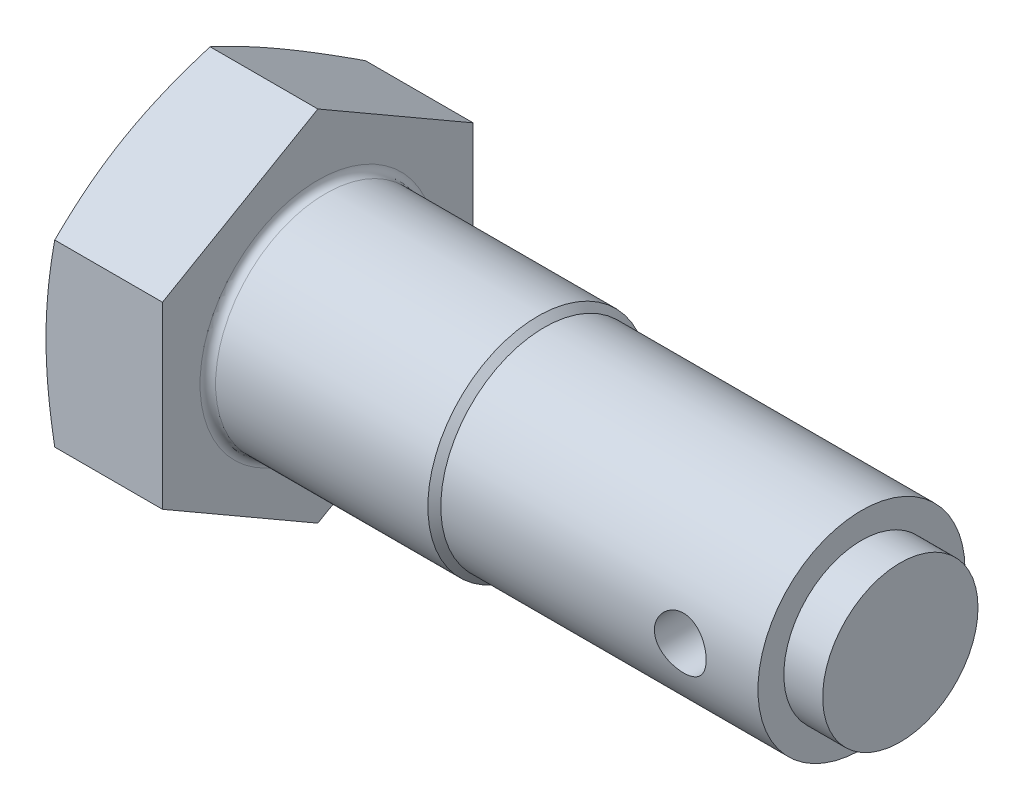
ISO-10303-21;
HEADER;
FILE_DESCRIPTION(('STEP AP214'),'2;1');
FILE_NAME('part.step','',(''),(''),'','','');
FILE_SCHEMA(('AUTOMOTIVE_DESIGN { 1 0 10303 214 1 1 1 1 }'));
ENDSEC;
DATA;
#1=APPLICATION_CONTEXT('core data for automotive mechanical design processes');
#2=APPLICATION_PROTOCOL_DEFINITION('international standard','automotive_design',2000,#1);
#3=PRODUCT_CONTEXT('',#1,'mechanical');
#4=PRODUCT('Part','Part','',(#3));
#5=PRODUCT_RELATED_PRODUCT_CATEGORY('part','',(#4));
#6=PRODUCT_DEFINITION_FORMATION('','',#4);
#7=PRODUCT_DEFINITION_CONTEXT('part definition',#1,'design');
#8=PRODUCT_DEFINITION('design','',#6,#7);
#9=PRODUCT_DEFINITION_SHAPE('','',#8);
#10=(LENGTH_UNIT() NAMED_UNIT(*) SI_UNIT(.MILLI.,.METRE.));
#11=(NAMED_UNIT(*) PLANE_ANGLE_UNIT() SI_UNIT($,.RADIAN.));
#12=(NAMED_UNIT(*) SI_UNIT($,.STERADIAN.) SOLID_ANGLE_UNIT());
#13=UNCERTAINTY_MEASURE_WITH_UNIT(LENGTH_MEASURE(1.E-05),#10,'distance_accuracy_value','');
#14=(GEOMETRIC_REPRESENTATION_CONTEXT(3) GLOBAL_UNCERTAINTY_ASSIGNED_CONTEXT((#13)) GLOBAL_UNIT_ASSIGNED_CONTEXT((#10,
#11,#12)) REPRESENTATION_CONTEXT('',''));
#15=CARTESIAN_POINT('',(0.,0.,0.));
#16=DIRECTION('',(0.,0.,1.));
#17=DIRECTION('',(1.,0.,0.));
#18=AXIS2_PLACEMENT_3D('',#15,#16,#17);
#19=CARTESIAN_POINT('',(9.,-6.92820323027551,12.));
#20=DIRECTION('',(0.,0.866025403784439,-0.5));
#21=DIRECTION('',(0.,0.5,0.866025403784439));
#22=AXIS2_PLACEMENT_3D('',#19,#20,#21);
#23=PLANE('',#22);
#24=CARTESIAN_POINT('',(0.67571872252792,-13.8565219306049,-0.000199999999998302));
#25=CARTESIAN_POINT('',(0.57125083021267,-13.5696002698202,0.496762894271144));
#26=CARTESIAN_POINT('',(0.476219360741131,-13.2817324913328,0.995364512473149));
#27=CARTESIAN_POINT('',(0.309026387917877,-12.7041252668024,1.99580957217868));
#28=CARTESIAN_POINT('',(0.236882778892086,-12.414384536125,2.49765523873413));
#29=CARTESIAN_POINT('',(0.120192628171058,-11.8362467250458,3.49901930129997));
#30=CARTESIAN_POINT('',(0.0753915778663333,-11.5478628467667,3.99851483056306));
#31=CARTESIAN_POINT('',(0.0153007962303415,-10.9704207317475,4.99867391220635));
#32=CARTESIAN_POINT('',(0.,-10.6813627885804,5.49933695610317));
#33=CARTESIAN_POINT('',(0.,-10.1032469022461,6.50066304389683));
#34=CARTESIAN_POINT('',(0.0153007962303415,-9.814188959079,7.00132608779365));
#35=CARTESIAN_POINT('',(0.0753915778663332,-9.2367468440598,8.00148516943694));
#36=CARTESIAN_POINT('',(0.120192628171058,-8.94836296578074,8.50098069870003));
#37=CARTESIAN_POINT('',(0.236882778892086,-8.37022515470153,9.50234476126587));
#38=CARTESIAN_POINT('',(0.309026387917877,-8.0804844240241,10.0041904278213));
#39=CARTESIAN_POINT('',(0.476219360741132,-7.50287719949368,11.0046354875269));
#40=CARTESIAN_POINT('',(0.57125083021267,-7.21500942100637,11.5032371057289));
#41=CARTESIAN_POINT('',(0.67571872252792,-6.92808776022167,12.0002));
#42=B_SPLINE_CURVE_WITH_KNOTS('',3,(#24,#25,#26,#27,#28,#29,#30,#31,#32,#33,#34,#35,#36,#37,#38,
#39,#40,#41),.UNSPECIFIED.,.F.,.F.,(4,2,2,2,2,2,2,2,4),(0.,1.75000540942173,3.50137566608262,
5.23618486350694,6.97034324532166,8.70450162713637,10.4393108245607,12.1906810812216,
13.9406864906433),.UNSPECIFIED.);
#43=CARTESIAN_POINT('',(0.675676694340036,-13.856406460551,0.));
#44=VERTEX_POINT('',#43);
#45=CARTESIAN_POINT('',(0.,-10.3923048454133,6.));
#46=VERTEX_POINT('',#45);
#47=EDGE_CURVE('E279',#44,#46,#42,.T.);
#48=ORIENTED_EDGE('',*,*,#47,.F.);
#49=DIRECTION('',(-1.,0.,0.));
#50=VECTOR('',#49,1.);
#51=CARTESIAN_POINT('',(9.,-13.856406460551,0.));
#52=LINE('',#51,#50);
#53=CARTESIAN_POINT('',(9.,-13.856406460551,0.));
#54=VERTEX_POINT('',#53);
#55=EDGE_CURVE('E149',#54,#44,#52,.T.);
#56=ORIENTED_EDGE('',*,*,#55,.F.);
#57=DIRECTION('',(0.,-0.5,-0.866025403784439));
#58=VECTOR('',#57,1.);
#59=CARTESIAN_POINT('',(9.,-6.92820323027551,12.));
#60=LINE('',#59,#58);
#61=CARTESIAN_POINT('',(9.,-6.92820323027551,12.));
#62=VERTEX_POINT('',#61);
#63=EDGE_CURVE('E291',#62,#54,#60,.T.);
#64=ORIENTED_EDGE('',*,*,#63,.F.);
#65=DIRECTION('',(-1.,0.,0.));
#66=VECTOR('',#65,1.);
#67=CARTESIAN_POINT('',(9.,-6.92820323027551,12.));
#68=LINE('',#67,#66);
#69=CARTESIAN_POINT('',(0.675676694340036,-6.92820323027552,12.));
#70=VERTEX_POINT('',#69);
#71=EDGE_CURVE('E136',#62,#70,#68,.T.);
#72=ORIENTED_EDGE('',*,*,#71,.T.);
#73=EDGE_CURVE('E130',#46,#70,#42,.T.);
#74=ORIENTED_EDGE('',*,*,#73,.F.);
#75=EDGE_LOOP('',(#48,#56,#64,#72,#74));
#76=FACE_BOUND('',#75,.T.);
#77=ADVANCED_FACE('F35',(#76),#23,.F.);
#78=CARTESIAN_POINT('',(9.,-13.856406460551,0.));
#79=DIRECTION('',(0.,0.866025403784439,0.5));
#80=DIRECTION('',(0.,-0.5,0.866025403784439));
#81=AXIS2_PLACEMENT_3D('',#78,#79,#80);
#82=PLANE('',#81);
#83=CARTESIAN_POINT('',(0.67571872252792,-6.92808776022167,-12.0002));
#84=CARTESIAN_POINT('',(0.571250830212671,-7.21500942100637,-11.5032371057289));
#85=CARTESIAN_POINT('',(0.476219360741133,-7.50287719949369,-11.0046354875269));
#86=CARTESIAN_POINT('',(0.309026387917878,-8.0804844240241,-10.0041904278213));
#87=CARTESIAN_POINT('',(0.236882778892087,-8.37022515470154,-9.50234476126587));
#88=CARTESIAN_POINT('',(0.120192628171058,-8.94836296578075,-8.50098069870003));
#89=CARTESIAN_POINT('',(0.075391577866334,-9.23674684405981,-8.00148516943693));
#90=CARTESIAN_POINT('',(0.0153007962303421,-9.814188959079,-7.00132608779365));
#91=CARTESIAN_POINT('',(0.,-10.1032469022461,-6.50066304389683));
#92=CARTESIAN_POINT('',(0.,-10.6813627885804,-5.49933695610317));
#93=CARTESIAN_POINT('',(0.0153007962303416,-10.9704207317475,-4.99867391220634));
#94=CARTESIAN_POINT('',(0.0753915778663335,-11.5478628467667,-3.99851483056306));
#95=CARTESIAN_POINT('',(0.120192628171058,-11.8362467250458,-3.49901930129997));
#96=CARTESIAN_POINT('',(0.236882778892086,-12.414384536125,-2.49765523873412));
#97=CARTESIAN_POINT('',(0.309026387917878,-12.7041252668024,-1.99580957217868));
#98=CARTESIAN_POINT('',(0.476219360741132,-13.2817324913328,-0.995364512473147));
#99=CARTESIAN_POINT('',(0.57125083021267,-13.5696002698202,-0.496762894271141));
#100=CARTESIAN_POINT('',(0.675718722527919,-13.8565219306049,0.000200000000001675));
#101=B_SPLINE_CURVE_WITH_KNOTS('',3,(#83,#84,#85,#86,#87,#88,#89,#90,#91,#92,#93,#94,#95,#96,
#97,#98,#99,#100),.UNSPECIFIED.,.F.,.F.,(4,2,2,2,2,2,2,2,4),(0.,1.75000540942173,
3.50137566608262,5.23618486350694,6.97034324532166,8.70450162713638,10.4393108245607,
12.1906810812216,13.9406864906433),.UNSPECIFIED.);
#102=CARTESIAN_POINT('',(0.675676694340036,-6.92820323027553,-12.));
#103=VERTEX_POINT('',#102);
#104=CARTESIAN_POINT('',(0.,-10.3923048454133,-6.));
#105=VERTEX_POINT('',#104);
#106=EDGE_CURVE('E226',#103,#105,#101,.T.);
#107=ORIENTED_EDGE('',*,*,#106,.F.);
#108=DIRECTION('',(-1.,0.,0.));
#109=VECTOR('',#108,1.);
#110=CARTESIAN_POINT('',(9.,-6.92820323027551,-12.));
#111=LINE('',#110,#109);
#112=CARTESIAN_POINT('',(9.,-6.92820323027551,-12.));
#113=VERTEX_POINT('',#112);
#114=EDGE_CURVE('E146',#113,#103,#111,.T.);
#115=ORIENTED_EDGE('',*,*,#114,.F.);
#116=DIRECTION('',(0.,0.5,-0.866025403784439));
#117=VECTOR('',#116,1.);
#118=CARTESIAN_POINT('',(9.,-13.856406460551,0.));
#119=LINE('',#118,#117);
#120=EDGE_CURVE('E286',#54,#113,#119,.T.);
#121=ORIENTED_EDGE('',*,*,#120,.F.);
#122=ORIENTED_EDGE('',*,*,#55,.T.);
#123=EDGE_CURVE('E222',#105,#44,#101,.T.);
#124=ORIENTED_EDGE('',*,*,#123,.F.);
#125=EDGE_LOOP('',(#107,#115,#121,#122,#124));
#126=FACE_BOUND('',#125,.T.);
#127=ADVANCED_FACE('F233',(#126),#82,.F.);
#128=CARTESIAN_POINT('',(9.,-6.92820323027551,-12.));
#129=DIRECTION('',(0.,0.,1.));
#130=DIRECTION('',(0.,-1.,0.));
#131=AXIS2_PLACEMENT_3D('',#128,#129,#130);
#132=PLANE('',#131);
#133=CARTESIAN_POINT('',(3.61054829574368,-18.3434460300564,-12.));
#134=CARTESIAN_POINT('',(3.44522832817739,-17.8005226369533,-12.));
#135=CARTESIAN_POINT('',(3.28183742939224,-17.2570009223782,-12.));
#136=CARTESIAN_POINT('',(2.95998092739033,-16.1684562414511,-12.));
#137=CARTESIAN_POINT('',(2.8015157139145,-15.6234331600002,-12.));
#138=CARTESIAN_POINT('',(2.49031413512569,-14.530648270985,-12.));
#139=CARTESIAN_POINT('',(2.3375890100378,-13.9828832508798,-12.));
#140=CARTESIAN_POINT('',(2.03965560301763,-12.8853155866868,-12.));
#141=CARTESIAN_POINT('',(1.89444718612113,-12.3355129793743,-12.));
#142=CARTESIAN_POINT('',(1.61514132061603,-11.2402977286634,-12.));
#143=CARTESIAN_POINT('',(1.4809289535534,-10.6949145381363,-12.));
#144=CARTESIAN_POINT('',(1.22393079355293,-9.60143426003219,-12.));
#145=CARTESIAN_POINT('',(1.10114519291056,-9.053337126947,-12.));
#146=CARTESIAN_POINT('',(0.869863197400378,-7.95430632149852,-12.));
#147=CARTESIAN_POINT('',(0.761361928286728,-7.40337368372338,-12.));
#148=CARTESIAN_POINT('',(0.561952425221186,-6.298309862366,-12.));
#149=CARTESIAN_POINT('',(0.471043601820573,-5.74417878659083,-12.));
#150=CARTESIAN_POINT('',(0.319513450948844,-4.69511542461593,-12.));
#151=CARTESIAN_POINT('',(0.256639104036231,-4.20051163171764,-12.));
#152=CARTESIAN_POINT('',(0.150207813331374,-3.20921261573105,-12.));
#153=CARTESIAN_POINT('',(0.106650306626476,-2.71251745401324,-12.));
#154=CARTESIAN_POINT('',(0.0409503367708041,-1.71804318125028,-12.));
#155=CARTESIAN_POINT('',(0.0187927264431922,-1.22026508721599,-12.));
#156=CARTESIAN_POINT('',(-0.00298561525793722,-0.224210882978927,-12.));
#157=CARTESIAN_POINT('',(-0.00260650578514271,0.274065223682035,-12.));
#158=CARTESIAN_POINT('',(0.0207270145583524,1.27260817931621,-12.));
#159=CARTESIAN_POINT('',(0.0437959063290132,1.77287230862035,-12.));
#160=CARTESIAN_POINT('',(0.111447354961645,2.77193116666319,-12.));
#161=CARTESIAN_POINT('',(0.156030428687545,3.27072585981,-12.));
#162=CARTESIAN_POINT('',(0.264624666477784,4.26659954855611,-12.));
#163=CARTESIAN_POINT('',(0.328652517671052,4.76367669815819,-12.));
#164=CARTESIAN_POINT('',(0.473539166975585,5.75534424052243,-12.));
#165=CARTESIAN_POINT('',(0.554398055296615,6.24993461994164,-12.));
#166=CARTESIAN_POINT('',(0.734968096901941,7.26265494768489,-12.));
#167=CARTESIAN_POINT('',(0.835450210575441,7.7806462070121,-12.));
#168=CARTESIAN_POINT('',(1.04934708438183,8.81396872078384,-12.));
#169=CARTESIAN_POINT('',(1.16276281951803,9.32929977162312,-12.));
#170=CARTESIAN_POINT('',(1.40014543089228,10.3576690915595,-12.));
#171=CARTESIAN_POINT('',(1.52411537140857,10.8707066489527,-12.));
#172=CARTESIAN_POINT('',(1.78058979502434,11.8946205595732,-12.));
#173=CARTESIAN_POINT('',(1.91309407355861,12.40549696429,-12.));
#174=CARTESIAN_POINT('',(2.18521643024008,13.4260476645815,-12.));
#175=CARTESIAN_POINT('',(2.32484342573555,13.9357195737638,-12.));
#176=CARTESIAN_POINT('',(2.6097776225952,14.9534709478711,-12.));
#177=CARTESIAN_POINT('',(2.75508484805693,15.4615504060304,-12.));
#178=CARTESIAN_POINT('',(3.05033772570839,16.4762621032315,-12.));
#179=CARTESIAN_POINT('',(3.20028257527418,16.982894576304,-12.));
#180=CARTESIAN_POINT('',(3.50403544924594,17.9950014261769,-12.));
#181=CARTESIAN_POINT('',(3.65784349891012,18.5004757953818,-12.));
#182=CARTESIAN_POINT('',(4.12063079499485,20.004263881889,-12.));
#183=CARTESIAN_POINT('',(4.43426661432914,21.0011442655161,-12.));
#184=CARTESIAN_POINT('',(5.07042607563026,22.9921033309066,-12.));
#185=CARTESIAN_POINT('',(5.39295014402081,23.9861818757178,-12.));
#186=CARTESIAN_POINT('',(6.04327981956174,25.9684300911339,-12.));
#187=CARTESIAN_POINT('',(6.37106074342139,26.9566078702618,-12.));
#188=CARTESIAN_POINT('',(6.866368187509,28.4376110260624,-12.));
#189=CARTESIAN_POINT('',(7.03206993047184,28.931048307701,-12.));
#190=CARTESIAN_POINT('',(7.3645456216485,29.9175602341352,-12.));
#191=CARTESIAN_POINT('',(7.53131956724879,30.4106348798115,-12.));
#192=CARTESIAN_POINT('',(7.69855799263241,30.9035520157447,-12.));
#193=B_SPLINE_CURVE_WITH_KNOTS('',3,(#133,#134,#135,#136,#137,#138,#139,#140,#141,#142,#143,
#144,#145,#146,#147,#148,#149,#150,#151,#152,#153,#154,#155,#156,#157,#158,#159,#160,#161,#162,
#163,#164,#165,#166,#167,#168,#169,#170,#171,#172,#173,#174,#175,#176,#177,#178,#179,#180,#181,
#182,#183,#184,#185,#186,#187,#188,#189,#190,#191,#192),.UNSPECIFIED.,.F.,.F.,(4,2,2,2,2,2,2,2,
2,2,2,2,2,2,2,2,2,2,2,2,2,2,2,2,2,2,2,2,2,4),(0.,1.7026184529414,3.40537128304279,
5.11130102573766,6.81720012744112,8.50206637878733,10.1869609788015,11.8712791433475,
13.5555408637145,15.0509647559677,16.5463450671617,18.040666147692,19.5349766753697,
21.0368655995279,22.5387906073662,24.0420081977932,25.5452338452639,27.1279731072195,
28.7108317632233,30.2941515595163,31.8774334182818,33.4627486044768,35.0480705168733,
36.6331195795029,38.2181790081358,41.3532733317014,44.4885183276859,47.6118671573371,
49.17341577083,50.7349605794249),.UNSPECIFIED.);
#194=CARTESIAN_POINT('',(0.675676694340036,6.92820323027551,-12.));
#195=VERTEX_POINT('',#194);
#196=CARTESIAN_POINT('',(0.,0.,-12.));
#197=VERTEX_POINT('',#196);
#198=EDGE_CURVE('E307',#195,#197,#193,.F.);
#199=ORIENTED_EDGE('',*,*,#198,.F.);
#200=DIRECTION('',(-1.,0.,0.));
#201=VECTOR('',#200,1.);
#202=CARTESIAN_POINT('',(9.,6.92820323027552,-12.));
#203=LINE('',#202,#201);
#204=CARTESIAN_POINT('',(9.,6.92820323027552,-12.));
#205=VERTEX_POINT('',#204);
#206=EDGE_CURVE('E138',#205,#195,#203,.T.);
#207=ORIENTED_EDGE('',*,*,#206,.F.);
#208=DIRECTION('',(0.,1.,0.));
#209=VECTOR('',#208,1.);
#210=CARTESIAN_POINT('',(9.,-6.92820323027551,-12.));
#211=LINE('',#210,#209);
#212=EDGE_CURVE('E290',#113,#205,#211,.T.);
#213=ORIENTED_EDGE('',*,*,#212,.F.);
#214=ORIENTED_EDGE('',*,*,#114,.T.);
#215=EDGE_CURVE('E227',#197,#103,#193,.F.);
#216=ORIENTED_EDGE('',*,*,#215,.F.);
#217=EDGE_LOOP('',(#199,#207,#213,#214,#216));
#218=FACE_BOUND('',#217,.T.);
#219=ADVANCED_FACE('F236',(#218),#132,.F.);
#220=CARTESIAN_POINT('',(9.,6.92820323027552,-12.));
#221=DIRECTION('',(0.,-0.866025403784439,0.5));
#222=DIRECTION('',(0.,-0.5,-0.866025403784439));
#223=AXIS2_PLACEMENT_3D('',#220,#221,#222);
#224=PLANE('',#223);
#225=CARTESIAN_POINT('',(0.675718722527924,13.8565219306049,0.000199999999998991));
#226=CARTESIAN_POINT('',(0.571250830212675,13.5696002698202,-0.496762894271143));
#227=CARTESIAN_POINT('',(0.476219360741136,13.2817324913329,-0.995364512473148));
#228=CARTESIAN_POINT('',(0.309026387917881,12.7041252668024,-1.99580957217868));
#229=CARTESIAN_POINT('',(0.23688277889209,12.414384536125,-2.49765523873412));
#230=CARTESIAN_POINT('',(0.120192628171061,11.8362467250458,-3.49901930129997));
#231=CARTESIAN_POINT('',(0.0753915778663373,11.5478628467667,-3.99851483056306));
#232=CARTESIAN_POINT('',(0.0153007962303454,10.9704207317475,-4.99867391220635));
#233=CARTESIAN_POINT('',(0.,10.6813627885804,-5.49933695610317));
#234=CARTESIAN_POINT('',(0.,10.1032469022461,-6.50066304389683));
#235=CARTESIAN_POINT('',(0.0153007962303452,9.81418895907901,-7.00132608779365));
#236=CARTESIAN_POINT('',(0.0753915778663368,9.23674684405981,-8.00148516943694));
#237=CARTESIAN_POINT('',(0.120192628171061,8.94836296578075,-8.50098069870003));
#238=CARTESIAN_POINT('',(0.236882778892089,8.37022515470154,-9.50234476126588));
#239=CARTESIAN_POINT('',(0.30902638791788,8.08048442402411,-10.0041904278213));
#240=CARTESIAN_POINT('',(0.476219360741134,7.50287719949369,-11.0046354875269));
#241=CARTESIAN_POINT('',(0.571250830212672,7.21500942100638,-11.5032371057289));
#242=CARTESIAN_POINT('',(0.675718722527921,6.92808776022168,-12.0002));
#243=B_SPLINE_CURVE_WITH_KNOTS('',3,(#225,#226,#227,#228,#229,#230,#231,#232,#233,#234,#235,
#236,#237,#238,#239,#240,#241,#242),.UNSPECIFIED.,.F.,.F.,(4,2,2,2,2,2,2,2,4),(0.,
1.75000540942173,3.50137566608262,5.23618486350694,6.97034324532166,8.70450162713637,
10.4393108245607,12.1906810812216,13.9406864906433),.UNSPECIFIED.);
#244=CARTESIAN_POINT('',(0.675676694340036,13.856406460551,0.));
#245=VERTEX_POINT('',#244);
#246=CARTESIAN_POINT('',(0.,10.3923048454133,-6.));
#247=VERTEX_POINT('',#246);
#248=EDGE_CURVE('E56',#245,#247,#243,.T.);
#249=ORIENTED_EDGE('',*,*,#248,.F.);
#250=DIRECTION('',(-1.,0.,0.));
#251=VECTOR('',#250,1.);
#252=CARTESIAN_POINT('',(9.,13.856406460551,0.));
#253=LINE('',#252,#251);
#254=CARTESIAN_POINT('',(9.,13.856406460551,0.));
#255=VERTEX_POINT('',#254);
#256=EDGE_CURVE('E135',#255,#245,#253,.T.);
#257=ORIENTED_EDGE('',*,*,#256,.F.);
#258=DIRECTION('',(0.,0.5,0.866025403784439));
#259=VECTOR('',#258,1.);
#260=CARTESIAN_POINT('',(9.,6.92820323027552,-12.));
#261=LINE('',#260,#259);
#262=EDGE_CURVE('E299',#205,#255,#261,.T.);
#263=ORIENTED_EDGE('',*,*,#262,.F.);
#264=ORIENTED_EDGE('',*,*,#206,.T.);
#265=EDGE_CURVE('E305',#247,#195,#243,.T.);
#266=ORIENTED_EDGE('',*,*,#265,.F.);
#267=EDGE_LOOP('',(#249,#257,#263,#264,#266));
#268=FACE_BOUND('',#267,.T.);
#269=ADVANCED_FACE('F240',(#268),#224,.F.);
#270=CARTESIAN_POINT('',(9.,13.856406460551,0.));
#271=DIRECTION('',(0.,-0.866025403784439,-0.5));
#272=DIRECTION('',(0.,0.5,-0.866025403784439));
#273=AXIS2_PLACEMENT_3D('',#270,#271,#272);
#274=PLANE('',#273);
#275=CARTESIAN_POINT('',(0.675718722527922,6.92808776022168,12.0002));
#276=CARTESIAN_POINT('',(0.571250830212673,7.21500942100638,11.5032371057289));
#277=CARTESIAN_POINT('',(0.476219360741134,7.50287719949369,11.0046354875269));
#278=CARTESIAN_POINT('',(0.30902638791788,8.08048442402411,10.0041904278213));
#279=CARTESIAN_POINT('',(0.236882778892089,8.37022515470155,9.50234476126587));
#280=CARTESIAN_POINT('',(0.12019262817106,8.94836296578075,8.50098069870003));
#281=CARTESIAN_POINT('',(0.0753915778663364,9.23674684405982,8.00148516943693));
#282=CARTESIAN_POINT('',(0.0153007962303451,9.81418895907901,7.00132608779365));
#283=CARTESIAN_POINT('',(0.,10.1032469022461,6.50066304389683));
#284=CARTESIAN_POINT('',(0.,10.6813627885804,5.49933695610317));
#285=CARTESIAN_POINT('',(0.0153007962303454,10.9704207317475,4.99867391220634));
#286=CARTESIAN_POINT('',(0.0753915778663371,11.5478628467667,3.99851483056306));
#287=CARTESIAN_POINT('',(0.120192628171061,11.8362467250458,3.49901930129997));
#288=CARTESIAN_POINT('',(0.23688277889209,12.414384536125,2.49765523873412));
#289=CARTESIAN_POINT('',(0.309026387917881,12.7041252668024,1.99580957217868));
#290=CARTESIAN_POINT('',(0.476219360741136,13.2817324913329,0.995364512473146));
#291=CARTESIAN_POINT('',(0.571250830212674,13.5696002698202,0.49676289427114));
#292=CARTESIAN_POINT('',(0.675718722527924,13.8565219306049,-0.00020000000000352));
#293=B_SPLINE_CURVE_WITH_KNOTS('',3,(#275,#276,#277,#278,#279,#280,#281,#282,#283,#284,#285,
#286,#287,#288,#289,#290,#291,#292),.UNSPECIFIED.,.F.,.F.,(4,2,2,2,2,2,2,2,4),(0.,
1.75000540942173,3.50137566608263,5.23618486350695,6.97034324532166,8.70450162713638,
10.4393108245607,12.1906810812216,13.9406864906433),.UNSPECIFIED.);
#294=CARTESIAN_POINT('',(0.675676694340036,6.92820323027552,12.));
#295=VERTEX_POINT('',#294);
#296=CARTESIAN_POINT('',(0.,10.3923048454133,6.));
#297=VERTEX_POINT('',#296);
#298=EDGE_CURVE('E64',#295,#297,#293,.T.);
#299=ORIENTED_EDGE('',*,*,#298,.F.);
#300=DIRECTION('',(-1.,0.,0.));
#301=VECTOR('',#300,1.);
#302=CARTESIAN_POINT('',(9.,6.92820323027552,12.));
#303=LINE('',#302,#301);
#304=CARTESIAN_POINT('',(9.,6.92820323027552,12.));
#305=VERTEX_POINT('',#304);
#306=EDGE_CURVE('E126',#305,#295,#303,.T.);
#307=ORIENTED_EDGE('',*,*,#306,.F.);
#308=DIRECTION('',(0.,-0.5,0.866025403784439));
#309=VECTOR('',#308,1.);
#310=CARTESIAN_POINT('',(9.,13.856406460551,0.));
#311=LINE('',#310,#309);
#312=EDGE_CURVE('E301',#255,#305,#311,.T.);
#313=ORIENTED_EDGE('',*,*,#312,.F.);
#314=ORIENTED_EDGE('',*,*,#256,.T.);
#315=EDGE_CURVE('E129',#297,#245,#293,.T.);
#316=ORIENTED_EDGE('',*,*,#315,.F.);
#317=EDGE_LOOP('',(#299,#307,#313,#314,#316));
#318=FACE_BOUND('',#317,.T.);
#319=ADVANCED_FACE('F124',(#318),#274,.F.);
#320=CARTESIAN_POINT('',(9.,6.92820323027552,12.));
#321=DIRECTION('',(0.,0.,-1.));
#322=DIRECTION('',(-1.,0.,0.));
#323=AXIS2_PLACEMENT_3D('',#320,#321,#322);
#324=PLANE('',#323);
#325=CARTESIAN_POINT('',(3.61054829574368,-18.3434460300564,12.));
#326=CARTESIAN_POINT('',(3.44522832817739,-17.8005226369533,12.));
#327=CARTESIAN_POINT('',(3.28183742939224,-17.2570009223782,12.));
#328=CARTESIAN_POINT('',(2.95998092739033,-16.1684562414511,12.));
#329=CARTESIAN_POINT('',(2.8015157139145,-15.6234331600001,12.));
#330=CARTESIAN_POINT('',(2.49031413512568,-14.530648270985,12.));
#331=CARTESIAN_POINT('',(2.33758901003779,-13.9828832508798,12.));
#332=CARTESIAN_POINT('',(2.03965560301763,-12.8853155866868,12.));
#333=CARTESIAN_POINT('',(1.89444718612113,-12.3355129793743,12.));
#334=CARTESIAN_POINT('',(1.61514132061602,-11.2402977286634,12.));
#335=CARTESIAN_POINT('',(1.4809289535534,-10.6949145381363,12.));
#336=CARTESIAN_POINT('',(1.22393079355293,-9.60143426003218,12.));
#337=CARTESIAN_POINT('',(1.10114519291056,-9.053337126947,12.));
#338=CARTESIAN_POINT('',(0.869863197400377,-7.95430632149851,12.));
#339=CARTESIAN_POINT('',(0.761361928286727,-7.40337368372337,12.));
#340=CARTESIAN_POINT('',(0.561952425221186,-6.29830986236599,12.));
#341=CARTESIAN_POINT('',(0.471043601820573,-5.74417878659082,12.));
#342=CARTESIAN_POINT('',(0.319513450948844,-4.69511542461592,12.));
#343=CARTESIAN_POINT('',(0.256639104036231,-4.20051163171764,12.));
#344=CARTESIAN_POINT('',(0.150207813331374,-3.20921261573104,12.));
#345=CARTESIAN_POINT('',(0.106650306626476,-2.71251745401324,12.));
#346=CARTESIAN_POINT('',(0.0409503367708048,-1.71804318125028,12.));
#347=CARTESIAN_POINT('',(0.0187927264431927,-1.22026508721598,12.));
#348=CARTESIAN_POINT('',(-0.00298561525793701,-0.224210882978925,12.));
#349=CARTESIAN_POINT('',(-0.00260650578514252,0.274065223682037,12.));
#350=CARTESIAN_POINT('',(0.0207270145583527,1.27260817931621,12.));
#351=CARTESIAN_POINT('',(0.0437959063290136,1.77287230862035,12.));
#352=CARTESIAN_POINT('',(0.111447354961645,2.77193116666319,12.));
#353=CARTESIAN_POINT('',(0.156030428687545,3.27072585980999,12.));
#354=CARTESIAN_POINT('',(0.264624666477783,4.26659954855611,12.));
#355=CARTESIAN_POINT('',(0.328652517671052,4.76367669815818,12.));
#356=CARTESIAN_POINT('',(0.473539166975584,5.75534424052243,12.));
#357=CARTESIAN_POINT('',(0.554398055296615,6.24993461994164,12.));
#358=CARTESIAN_POINT('',(0.734968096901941,7.26265494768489,12.));
#359=CARTESIAN_POINT('',(0.835450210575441,7.7806462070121,12.));
#360=CARTESIAN_POINT('',(1.04934708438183,8.81396872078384,12.));
#361=CARTESIAN_POINT('',(1.16276281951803,9.32929977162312,12.));
#362=CARTESIAN_POINT('',(1.40014543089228,10.3576690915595,12.));
#363=CARTESIAN_POINT('',(1.52411537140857,10.8707066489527,12.));
#364=CARTESIAN_POINT('',(1.78058979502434,11.8946205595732,12.));
#365=CARTESIAN_POINT('',(1.91309407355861,12.40549696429,12.));
#366=CARTESIAN_POINT('',(2.18521643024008,13.4260476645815,12.));
#367=CARTESIAN_POINT('',(2.32484342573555,13.9357195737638,12.));
#368=CARTESIAN_POINT('',(2.6097776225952,14.953470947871,12.));
#369=CARTESIAN_POINT('',(2.75508484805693,15.4615504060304,12.));
#370=CARTESIAN_POINT('',(3.05033772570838,16.4762621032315,12.));
#371=CARTESIAN_POINT('',(3.20028257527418,16.982894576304,12.));
#372=CARTESIAN_POINT('',(3.50403544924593,17.9950014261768,12.));
#373=CARTESIAN_POINT('',(3.65784349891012,18.5004757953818,12.));
#374=CARTESIAN_POINT('',(4.12063079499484,20.004263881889,12.));
#375=CARTESIAN_POINT('',(4.43426661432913,21.0011442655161,12.));
#376=CARTESIAN_POINT('',(5.07042607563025,22.9921033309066,12.));
#377=CARTESIAN_POINT('',(5.39295014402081,23.9861818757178,12.));
#378=CARTESIAN_POINT('',(6.04327981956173,25.9684300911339,12.));
#379=CARTESIAN_POINT('',(6.37106074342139,26.9566078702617,12.));
#380=CARTESIAN_POINT('',(6.86636818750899,28.4376110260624,12.));
#381=CARTESIAN_POINT('',(7.03206993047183,28.931048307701,12.));
#382=CARTESIAN_POINT('',(7.3645456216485,29.9175602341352,12.));
#383=CARTESIAN_POINT('',(7.53131956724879,30.4106348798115,12.));
#384=CARTESIAN_POINT('',(7.69855799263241,30.9035520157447,12.));
#385=B_SPLINE_CURVE_WITH_KNOTS('',3,(#325,#326,#327,#328,#329,#330,#331,#332,#333,#334,#335,
#336,#337,#338,#339,#340,#341,#342,#343,#344,#345,#346,#347,#348,#349,#350,#351,#352,#353,#354,
#355,#356,#357,#358,#359,#360,#361,#362,#363,#364,#365,#366,#367,#368,#369,#370,#371,#372,#373,
#374,#375,#376,#377,#378,#379,#380,#381,#382,#383,#384),.UNSPECIFIED.,.F.,.F.,(4,2,2,2,2,2,2,2,
2,2,2,2,2,2,2,2,2,2,2,2,2,2,2,2,2,2,2,2,2,4),(0.,1.70261845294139,3.40537128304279,
5.11130102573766,6.81720012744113,8.50206637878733,10.1869609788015,11.8712791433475,
13.5555408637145,15.0509647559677,16.5463450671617,18.040666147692,19.5349766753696,
21.0368655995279,22.5387906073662,24.0420081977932,25.5452338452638,27.1279731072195,
28.7108317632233,30.2941515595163,31.8774334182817,33.4627486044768,35.0480705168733,
36.6331195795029,38.2181790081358,41.3532733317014,44.4885183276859,47.6118671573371,
49.17341577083,50.7349605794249),.UNSPECIFIED.);
#386=CARTESIAN_POINT('',(0.,0.,12.));
#387=VERTEX_POINT('',#386);
#388=EDGE_CURVE('E119',#70,#387,#385,.T.);
#389=ORIENTED_EDGE('',*,*,#388,.F.);
#390=ORIENTED_EDGE('',*,*,#71,.F.);
#391=DIRECTION('',(0.,-1.,0.));
#392=VECTOR('',#391,1.);
#393=CARTESIAN_POINT('',(9.,6.92820323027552,12.));
#394=LINE('',#393,#392);
#395=EDGE_CURVE('E134',#305,#62,#394,.T.);
#396=ORIENTED_EDGE('',*,*,#395,.F.);
#397=ORIENTED_EDGE('',*,*,#306,.T.);
#398=EDGE_CURVE('E111',#387,#295,#385,.T.);
#399=ORIENTED_EDGE('',*,*,#398,.F.);
#400=EDGE_LOOP('',(#389,#390,#396,#397,#399));
#401=FACE_BOUND('',#400,.T.);
#402=ADVANCED_FACE('F132',(#401),#324,.F.);
#403=CARTESIAN_POINT('',(121.62741699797,0.,0.));
#404=DIRECTION('',(-1.,0.,0.));
#405=DIRECTION('',(0.,0.,1.));
#406=AXIS2_PLACEMENT_3D('',#403,#404,#405);
#407=CYLINDRICAL_SURFACE('',#406,8.);
#408=CARTESIAN_POINT('',(47.,0.,8.));
#409=CARTESIAN_POINT('',(46.9999968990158,-0.110501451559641,7.9999981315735));
#410=CARTESIAN_POINT('',(46.990811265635,-0.22103754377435,7.99768770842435));
#411=CARTESIAN_POINT('',(46.954366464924,-0.438941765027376,7.98869485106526));
#412=CARTESIAN_POINT('',(46.9270970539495,-0.546308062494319,7.98200993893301));
#413=CARTESIAN_POINT('',(46.8554143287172,-0.754694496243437,7.96500835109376));
#414=CARTESIAN_POINT('',(46.811021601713,-0.855722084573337,7.95469603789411));
#415=CARTESIAN_POINT('',(46.7064248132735,-1.04889617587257,7.93153791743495));
#416=CARTESIAN_POINT('',(46.646220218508,-1.14104237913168,7.91869202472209));
#417=CARTESIAN_POINT('',(46.5103989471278,-1.31573590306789,7.89156551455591));
#418=CARTESIAN_POINT('',(46.4345179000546,-1.39807425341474,7.87726276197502));
#419=CARTESIAN_POINT('',(46.270063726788,-1.54899856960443,7.84898160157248));
#420=CARTESIAN_POINT('',(46.1814891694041,-1.61758298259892,7.83500323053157));
#421=CARTESIAN_POINT('',(45.992539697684,-1.74003539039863,7.80873034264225));
#422=CARTESIAN_POINT('',(45.8920090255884,-1.79366962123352,7.79646392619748));
#423=CARTESIAN_POINT('',(45.6830021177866,-1.88319587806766,7.77532659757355));
#424=CARTESIAN_POINT('',(45.5745271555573,-1.91909074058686,7.76645514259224));
#425=CARTESIAN_POINT('',(45.3550086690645,-1.97140644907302,7.7533396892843));
#426=CARTESIAN_POINT('',(45.244060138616,-1.98820302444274,7.74900654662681));
#427=CARTESIAN_POINT('',(45.0208419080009,-2.00301570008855,7.74519149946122));
#428=CARTESIAN_POINT('',(44.9085724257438,-2.00103485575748,7.74570880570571));
#429=CARTESIAN_POINT('',(44.6887789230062,-1.97864869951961,7.75145607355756));
#430=CARTESIAN_POINT('',(44.5812058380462,-1.95869112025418,7.75657150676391));
#431=CARTESIAN_POINT('',(44.3709852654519,-1.90163224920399,7.77075612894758));
#432=CARTESIAN_POINT('',(44.2683381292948,-1.86452973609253,7.77982559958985));
#433=CARTESIAN_POINT('',(44.0696826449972,-1.77385263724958,7.80100151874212));
#434=CARTESIAN_POINT('',(43.9737517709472,-1.72011555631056,7.81313769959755));
#435=CARTESIAN_POINT('',(43.7921083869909,-1.59780836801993,7.83906281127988));
#436=CARTESIAN_POINT('',(43.7063976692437,-1.52923566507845,7.85285203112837));
#437=CARTESIAN_POINT('',(43.5450618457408,-1.37688456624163,7.88101174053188));
#438=CARTESIAN_POINT('',(43.4697940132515,-1.29272834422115,7.89538759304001));
#439=CARTESIAN_POINT('',(43.3343716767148,-1.11281589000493,7.92274620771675));
#440=CARTESIAN_POINT('',(43.2742176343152,-1.01705930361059,7.93572892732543));
#441=CARTESIAN_POINT('',(43.1705992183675,-0.816154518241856,7.9589030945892));
#442=CARTESIAN_POINT('',(43.1271928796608,-0.710975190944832,7.96908480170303));
#443=CARTESIAN_POINT('',(43.0587769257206,-0.49450134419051,7.98543889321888));
#444=CARTESIAN_POINT('',(43.0337637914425,-0.383207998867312,7.99161204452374));
#445=CARTESIAN_POINT('',(43.0033899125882,-0.160719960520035,7.999139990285));
#446=CARTESIAN_POINT('',(42.9975426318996,-0.0495956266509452,8.00061404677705));
#447=CARTESIAN_POINT('',(43.0043320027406,0.172043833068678,7.99891739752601));
#448=CARTESIAN_POINT('',(43.0169669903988,0.28255901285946,7.99574710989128));
#449=CARTESIAN_POINT('',(43.0599612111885,0.498152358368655,7.98519441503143));
#450=CARTESIAN_POINT('',(43.0900550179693,0.603286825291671,7.97787512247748));
#451=CARTESIAN_POINT('',(43.1668094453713,0.807009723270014,7.95984942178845));
#452=CARTESIAN_POINT('',(43.2134717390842,0.905597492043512,7.94914267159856));
#453=CARTESIAN_POINT('',(43.3229815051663,1.0953641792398,7.92524410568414));
#454=CARTESIAN_POINT('',(43.3861014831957,1.18638058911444,7.91201156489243));
#455=CARTESIAN_POINT('',(43.5263865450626,1.35670215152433,7.88459345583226));
#456=CARTESIAN_POINT('',(43.6035540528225,1.43600527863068,7.87040772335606));
#457=CARTESIAN_POINT('',(43.7720026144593,1.58265409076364,7.84225275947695));
#458=CARTESIAN_POINT('',(43.8635836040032,1.64965849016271,7.82829738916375));
#459=CARTESIAN_POINT('',(44.0569768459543,1.7673476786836,7.80257171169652));
#460=CARTESIAN_POINT('',(44.1587886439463,1.81803319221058,7.79080130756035));
#461=CARTESIAN_POINT('',(44.3692076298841,1.90126856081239,7.77090792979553));
#462=CARTESIAN_POINT('',(44.4777701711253,1.93392586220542,7.76276340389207));
#463=CARTESIAN_POINT('',(44.6990795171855,1.98046087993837,7.75102325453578));
#464=CARTESIAN_POINT('',(44.8118254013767,1.99434270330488,7.74742663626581));
#465=CARTESIAN_POINT('',(45.0348280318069,2.00271812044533,7.74526534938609));
#466=CARTESIAN_POINT('',(45.145063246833,1.99775719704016,7.74655910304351));
#467=CARTESIAN_POINT('',(45.3630718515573,1.96983637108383,7.7537054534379));
#468=CARTESIAN_POINT('',(45.4708452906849,1.94687683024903,7.75955795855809));
#469=CARTESIAN_POINT('',(45.6802779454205,1.88390842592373,7.77508347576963));
#470=CARTESIAN_POINT('',(45.7819697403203,1.84400187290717,7.78473353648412));
#471=CARTESIAN_POINT('',(45.9772871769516,1.7483532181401,7.80677007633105));
#472=CARTESIAN_POINT('',(46.0709116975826,1.69260892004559,7.81915693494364));
#473=CARTESIAN_POINT('',(46.2500728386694,1.56515699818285,7.84567512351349));
#474=CARTESIAN_POINT('',(46.3353347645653,1.49307088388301,7.85984353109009));
#475=CARTESIAN_POINT('',(46.4927293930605,1.33571916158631,7.88810702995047));
#476=CARTESIAN_POINT('',(46.564858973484,1.2504504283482,7.90220210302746));
#477=CARTESIAN_POINT('',(46.6952150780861,1.06729011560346,7.9290354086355));
#478=CARTESIAN_POINT('',(46.7531661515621,0.969197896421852,7.94174444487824));
#479=CARTESIAN_POINT('',(46.8516632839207,0.764354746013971,7.96406566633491));
#480=CARTESIAN_POINT('',(46.892221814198,0.65761008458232,7.97368006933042));
#481=CARTESIAN_POINT('',(46.9487624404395,0.459213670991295,7.98730746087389));
#482=CARTESIAN_POINT('',(46.9679349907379,0.36850689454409,7.9920344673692));
#483=CARTESIAN_POINT('',(46.9935545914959,0.18520809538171,7.99838140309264));
#484=CARTESIAN_POINT('',(47.0000025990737,0.0926162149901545,8.00000156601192));
#485=CARTESIAN_POINT('',(47.,0.,8.));
#486=B_SPLINE_CURVE_WITH_KNOTS('',3,(#408,#409,#410,#411,#412,#413,#414,#415,#416,#417,#418,
#419,#420,#421,#422,#423,#424,#425,#426,#427,#428,#429,#430,#431,#432,#433,#434,#435,#436,#437,
#438,#439,#440,#441,#442,#443,#444,#445,#446,#447,#448,#449,#450,#451,#452,#453,#454,#455,#456,
#457,#458,#459,#460,#461,#462,#463,#464,#465,#466,#467,#468,#469,#470,#471,#472,#473,#474,#475,
#476,#477,#478,#479,#480,#481,#482,#483,#484,#485),.UNSPECIFIED.,.T.,.F.,(4,2,2,2,2,2,2,2,2,2,2,
2,2,2,2,2,2,2,2,2,2,2,2,2,2,2,2,2,2,2,2,2,2,2,2,2,2,2,4),(0.,0.33116494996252,0.662517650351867,
0.993473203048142,1.32443992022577,1.66152580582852,1.99864972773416,2.34078196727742,
2.68285948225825,3.01808393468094,3.35325384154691,3.68029996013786,4.00736937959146,
4.33774037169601,4.66816921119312,5.00802001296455,5.34788119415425,5.68890972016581,
6.02987298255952,6.36211078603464,6.69431868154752,7.02160366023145,7.34892169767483,
7.68204783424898,8.01523150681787,8.35659345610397,8.69794025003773,9.03723006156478,
9.37644564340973,9.70591707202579,10.0353818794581,10.3628853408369,10.6904342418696,
11.0265276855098,11.3627009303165,11.7049624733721,12.046978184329,12.324563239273,
12.6021274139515),.UNSPECIFIED.);
#487=CARTESIAN_POINT('',(47.,0.,8.));
#488=VERTEX_POINT('',#487);
#489=EDGE_CURVE('E39',#488,#488,#486,.T.);
#490=ORIENTED_EDGE('',*,*,#489,.T.);
#491=EDGE_LOOP('',(#490));
#492=FACE_BOUND('',#491,.T.);
#493=CARTESIAN_POINT('',(47.,0.,-8.));
#494=CARTESIAN_POINT('',(46.9999968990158,0.110501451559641,-7.99999813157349));
#495=CARTESIAN_POINT('',(46.990811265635,0.22103754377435,-7.99768770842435));
#496=CARTESIAN_POINT('',(46.954366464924,0.438941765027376,-7.98869485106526));
#497=CARTESIAN_POINT('',(46.9270970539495,0.546308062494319,-7.98200993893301));
#498=CARTESIAN_POINT('',(46.8554143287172,0.754694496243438,-7.96500835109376));
#499=CARTESIAN_POINT('',(46.811021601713,0.85572208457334,-7.95469603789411));
#500=CARTESIAN_POINT('',(46.7064248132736,1.04889617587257,-7.93153791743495));
#501=CARTESIAN_POINT('',(46.646220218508,1.14104237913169,-7.91869202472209));
#502=CARTESIAN_POINT('',(46.5103989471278,1.31573590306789,-7.89156551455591));
#503=CARTESIAN_POINT('',(46.4345179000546,1.39807425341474,-7.87726276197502));
#504=CARTESIAN_POINT('',(46.270063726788,1.54899856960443,-7.84898160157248));
#505=CARTESIAN_POINT('',(46.1814891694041,1.61758298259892,-7.83500323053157));
#506=CARTESIAN_POINT('',(45.992539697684,1.74003539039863,-7.80873034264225));
#507=CARTESIAN_POINT('',(45.8920090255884,1.79366962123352,-7.79646392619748));
#508=CARTESIAN_POINT('',(45.6830021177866,1.88319587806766,-7.77532659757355));
#509=CARTESIAN_POINT('',(45.5745271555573,1.91909074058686,-7.76645514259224));
#510=CARTESIAN_POINT('',(45.3550086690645,1.97140644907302,-7.7533396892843));
#511=CARTESIAN_POINT('',(45.244060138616,1.98820302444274,-7.74900654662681));
#512=CARTESIAN_POINT('',(45.0208419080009,2.00301570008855,-7.74519149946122));
#513=CARTESIAN_POINT('',(44.9085724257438,2.00103485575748,-7.74570880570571));
#514=CARTESIAN_POINT('',(44.6887789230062,1.97864869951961,-7.75145607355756));
#515=CARTESIAN_POINT('',(44.5812058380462,1.95869112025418,-7.75657150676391));
#516=CARTESIAN_POINT('',(44.3709852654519,1.90163224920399,-7.77075612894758));
#517=CARTESIAN_POINT('',(44.2683381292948,1.86452973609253,-7.77982559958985));
#518=CARTESIAN_POINT('',(44.0696826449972,1.77385263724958,-7.80100151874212));
#519=CARTESIAN_POINT('',(43.9737517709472,1.72011555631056,-7.81313769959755));
#520=CARTESIAN_POINT('',(43.7921083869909,1.59780836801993,-7.83906281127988));
#521=CARTESIAN_POINT('',(43.7063976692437,1.52923566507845,-7.85285203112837));
#522=CARTESIAN_POINT('',(43.5450618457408,1.37688456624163,-7.88101174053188));
#523=CARTESIAN_POINT('',(43.4697940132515,1.29272834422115,-7.89538759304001));
#524=CARTESIAN_POINT('',(43.3343716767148,1.11281589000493,-7.92274620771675));
#525=CARTESIAN_POINT('',(43.2742176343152,1.01705930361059,-7.93572892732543));
#526=CARTESIAN_POINT('',(43.1705992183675,0.816154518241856,-7.9589030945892));
#527=CARTESIAN_POINT('',(43.1271928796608,0.710975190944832,-7.96908480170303));
#528=CARTESIAN_POINT('',(43.0587769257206,0.49450134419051,-7.98543889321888));
#529=CARTESIAN_POINT('',(43.0337637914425,0.383207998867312,-7.99161204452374));
#530=CARTESIAN_POINT('',(43.0033899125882,0.160719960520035,-7.999139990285));
#531=CARTESIAN_POINT('',(42.9975426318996,0.0495956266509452,-8.00061404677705));
#532=CARTESIAN_POINT('',(43.0043320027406,-0.172043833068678,-7.99891739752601));
#533=CARTESIAN_POINT('',(43.0169669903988,-0.28255901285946,-7.99574710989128));
#534=CARTESIAN_POINT('',(43.0599612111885,-0.498152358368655,-7.98519441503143));
#535=CARTESIAN_POINT('',(43.0900550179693,-0.603286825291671,-7.97787512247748));
#536=CARTESIAN_POINT('',(43.1668094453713,-0.807009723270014,-7.95984942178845));
#537=CARTESIAN_POINT('',(43.2134717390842,-0.905597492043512,-7.94914267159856));
#538=CARTESIAN_POINT('',(43.3229815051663,-1.0953641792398,-7.92524410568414));
#539=CARTESIAN_POINT('',(43.3861014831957,-1.18638058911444,-7.91201156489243));
#540=CARTESIAN_POINT('',(43.5263865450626,-1.35670215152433,-7.88459345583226));
#541=CARTESIAN_POINT('',(43.6035540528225,-1.43600527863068,-7.87040772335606));
#542=CARTESIAN_POINT('',(43.7720026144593,-1.58265409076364,-7.84225275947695));
#543=CARTESIAN_POINT('',(43.8635836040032,-1.64965849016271,-7.82829738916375));
#544=CARTESIAN_POINT('',(44.0569768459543,-1.7673476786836,-7.80257171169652));
#545=CARTESIAN_POINT('',(44.1587886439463,-1.81803319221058,-7.79080130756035));
#546=CARTESIAN_POINT('',(44.3692076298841,-1.90126856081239,-7.77090792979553));
#547=CARTESIAN_POINT('',(44.4777701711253,-1.93392586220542,-7.76276340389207));
#548=CARTESIAN_POINT('',(44.6990795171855,-1.98046087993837,-7.75102325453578));
#549=CARTESIAN_POINT('',(44.8118254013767,-1.99434270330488,-7.74742663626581));
#550=CARTESIAN_POINT('',(45.0348280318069,-2.00271812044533,-7.74526534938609));
#551=CARTESIAN_POINT('',(45.145063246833,-1.99775719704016,-7.74655910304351));
#552=CARTESIAN_POINT('',(45.3630718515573,-1.96983637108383,-7.7537054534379));
#553=CARTESIAN_POINT('',(45.4708452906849,-1.94687683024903,-7.75955795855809));
#554=CARTESIAN_POINT('',(45.6802779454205,-1.88390842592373,-7.77508347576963));
#555=CARTESIAN_POINT('',(45.7819697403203,-1.84400187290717,-7.78473353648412));
#556=CARTESIAN_POINT('',(45.9772871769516,-1.7483532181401,-7.80677007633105));
#557=CARTESIAN_POINT('',(46.0709116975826,-1.69260892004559,-7.81915693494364));
#558=CARTESIAN_POINT('',(46.2500728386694,-1.56515699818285,-7.8456751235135));
#559=CARTESIAN_POINT('',(46.3353347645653,-1.49307088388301,-7.85984353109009));
#560=CARTESIAN_POINT('',(46.4927293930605,-1.33571916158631,-7.88810702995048));
#561=CARTESIAN_POINT('',(46.564858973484,-1.25045042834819,-7.90220210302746));
#562=CARTESIAN_POINT('',(46.6952150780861,-1.06729011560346,-7.9290354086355));
#563=CARTESIAN_POINT('',(46.7531661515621,-0.969197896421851,-7.94174444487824));
#564=CARTESIAN_POINT('',(46.8516632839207,-0.764354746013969,-7.96406566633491));
#565=CARTESIAN_POINT('',(46.892221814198,-0.657610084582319,-7.97368006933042));
#566=CARTESIAN_POINT('',(46.9487624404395,-0.459213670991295,-7.98730746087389));
#567=CARTESIAN_POINT('',(46.9679349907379,-0.368506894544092,-7.99203446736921));
#568=CARTESIAN_POINT('',(46.9935545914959,-0.185208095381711,-7.99838140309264));
#569=CARTESIAN_POINT('',(47.0000025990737,-0.0926162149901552,-8.00000156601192));
#570=CARTESIAN_POINT('',(47.,0.,-8.));
#571=B_SPLINE_CURVE_WITH_KNOTS('',3,(#493,#494,#495,#496,#497,#498,#499,#500,#501,#502,#503,
#504,#505,#506,#507,#508,#509,#510,#511,#512,#513,#514,#515,#516,#517,#518,#519,#520,#521,#522,
#523,#524,#525,#526,#527,#528,#529,#530,#531,#532,#533,#534,#535,#536,#537,#538,#539,#540,#541,
#542,#543,#544,#545,#546,#547,#548,#549,#550,#551,#552,#553,#554,#555,#556,#557,#558,#559,#560,
#561,#562,#563,#564,#565,#566,#567,#568,#569,#570),.UNSPECIFIED.,.T.,.F.,(4,2,2,2,2,2,2,2,2,2,2,
2,2,2,2,2,2,2,2,2,2,2,2,2,2,2,2,2,2,2,2,2,2,2,2,2,2,2,4),(0.,0.331164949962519,
0.662517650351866,0.993473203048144,1.32443992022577,1.66152580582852,1.99864972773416,
2.34078196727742,2.68285948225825,3.01808393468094,3.35325384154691,3.68029996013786,
4.00736937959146,4.33774037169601,4.66816921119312,5.00802001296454,5.34788119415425,
5.6889097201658,6.02987298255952,6.36211078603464,6.69431868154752,7.02160366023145,
7.34892169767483,7.68204783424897,8.01523150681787,8.35659345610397,8.69794025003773,
9.03723006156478,9.37644564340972,9.70591707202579,10.0353818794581,10.3628853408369,
10.6904342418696,11.0265276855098,11.3627009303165,11.7049624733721,12.046978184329,
12.3245632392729,12.6021274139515),.UNSPECIFIED.);
#572=CARTESIAN_POINT('',(47.,0.,-8.));
#573=VERTEX_POINT('',#572);
#574=EDGE_CURVE('E166',#573,#573,#571,.T.);
#575=ORIENTED_EDGE('',*,*,#574,.T.);
#576=EDGE_LOOP('',(#575));
#577=FACE_BOUND('',#576,.T.);
#578=CARTESIAN_POINT('',(26.5000000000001,0.,0.));
#579=DIRECTION('',(1.,0.,0.));
#580=DIRECTION('',(0.,0.,-1.));
#581=AXIS2_PLACEMENT_3D('',#578,#579,#580);
#582=CIRCLE('',#581,8.);
#583=CARTESIAN_POINT('',(26.5000000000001,0.,-8.));
#584=VERTEX_POINT('',#583);
#585=EDGE_CURVE('E13',#584,#584,#582,.T.);
#586=ORIENTED_EDGE('',*,*,#585,.T.);
#587=EDGE_LOOP('',(#586));
#588=FACE_BOUND('',#587,.T.);
#589=CARTESIAN_POINT('',(51.,0.,0.));
#590=DIRECTION('',(1.,0.,0.));
#591=DIRECTION('',(0.,0.,-1.));
#592=AXIS2_PLACEMENT_3D('',#589,#590,#591);
#593=CIRCLE('',#592,8.);
#594=CARTESIAN_POINT('',(51.,0.,-8.));
#595=VERTEX_POINT('',#594);
#596=EDGE_CURVE('E153',#595,#595,#593,.T.);
#597=ORIENTED_EDGE('',*,*,#596,.F.);
#598=EDGE_LOOP('',(#597));
#599=FACE_BOUND('',#598,.T.);
#600=ADVANCED_FACE('F170',(#492,#577,#588,#599),#407,.T.);
#601=CARTESIAN_POINT('',(9.,-20.7846096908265,-12.));
#602=DIRECTION('',(1.,0.,0.));
#603=DIRECTION('',(0.,0.,-1.));
#604=AXIS2_PLACEMENT_3D('',#601,#602,#603);
#605=PLANE('',#604);
#606=CARTESIAN_POINT('',(9.,0.,0.));
#607=DIRECTION('',(1.,0.,0.));
#608=DIRECTION('',(0.,0.,-1.));
#609=AXIS2_PLACEMENT_3D('',#606,#607,#608);
#610=CIRCLE('',#609,9.1);
#611=CARTESIAN_POINT('',(9.,0.,-9.1));
#612=VERTEX_POINT('',#611);
#613=EDGE_CURVE('E48',#612,#612,#610,.F.);
#614=ORIENTED_EDGE('',*,*,#613,.T.);
#615=EDGE_LOOP('',(#614));
#616=FACE_BOUND('',#615,.T.);
#617=ORIENTED_EDGE('',*,*,#63,.T.);
#618=ORIENTED_EDGE('',*,*,#120,.T.);
#619=ORIENTED_EDGE('',*,*,#212,.T.);
#620=ORIENTED_EDGE('',*,*,#262,.T.);
#621=ORIENTED_EDGE('',*,*,#312,.T.);
#622=ORIENTED_EDGE('',*,*,#395,.T.);
#623=EDGE_LOOP('',(#617,#618,#619,#620,#621,#622));
#624=FACE_BOUND('',#623,.T.);
#625=ADVANCED_FACE('F250',(#616,#624),#605,.T.);
#626=CARTESIAN_POINT('',(26.,0.,0.));
#627=DIRECTION('',(-1.,0.,0.));
#628=DIRECTION('',(0.,0.,1.));
#629=AXIS2_PLACEMENT_3D('',#626,#627,#628);
#630=CYLINDRICAL_SURFACE('',#629,8.5);
#631=CARTESIAN_POINT('',(9.6,0.,0.));
#632=DIRECTION('',(1.,0.,0.));
#633=DIRECTION('',(0.,0.,-1.));
#634=AXIS2_PLACEMENT_3D('',#631,#632,#633);
#635=CIRCLE('',#634,8.5);
#636=CARTESIAN_POINT('',(9.6,0.,-8.5));
#637=VERTEX_POINT('',#636);
#638=EDGE_CURVE('E162',#637,#637,#635,.T.);
#639=ORIENTED_EDGE('',*,*,#638,.T.);
#640=EDGE_LOOP('',(#639));
#641=FACE_BOUND('',#640,.T.);
#642=CARTESIAN_POINT('',(26.,0.,0.));
#643=DIRECTION('',(1.,0.,0.));
#644=DIRECTION('',(0.,0.,-1.));
#645=AXIS2_PLACEMENT_3D('',#642,#643,#644);
#646=CIRCLE('',#645,8.5);
#647=CARTESIAN_POINT('',(26.,0.,-8.5));
#648=VERTEX_POINT('',#647);
#649=EDGE_CURVE('E156',#648,#648,#646,.T.);
#650=ORIENTED_EDGE('',*,*,#649,.F.);
#651=EDGE_LOOP('',(#650));
#652=FACE_BOUND('',#651,.T.);
#653=ADVANCED_FACE('F253',(#641,#652),#630,.T.);
#654=CARTESIAN_POINT('',(51.,0.,0.));
#655=DIRECTION('',(1.,0.,0.));
#656=DIRECTION('',(0.,0.,-1.));
#657=AXIS2_PLACEMENT_3D('',#654,#655,#656);
#658=PLANE('',#657);
#659=CARTESIAN_POINT('',(51.,0.,0.));
#660=DIRECTION('',(1.,0.,0.));
#661=DIRECTION('',(0.,0.,-1.));
#662=AXIS2_PLACEMENT_3D('',#659,#660,#661);
#663=CIRCLE('',#662,6.);
#664=CARTESIAN_POINT('',(51.,0.,-6.));
#665=VERTEX_POINT('',#664);
#666=EDGE_CURVE('E157',#665,#665,#663,.T.);
#667=ORIENTED_EDGE('',*,*,#666,.F.);
#668=EDGE_LOOP('',(#667));
#669=FACE_BOUND('',#668,.T.);
#670=ORIENTED_EDGE('',*,*,#596,.T.);
#671=EDGE_LOOP('',(#670));
#672=FACE_BOUND('',#671,.T.);
#673=ADVANCED_FACE('F259',(#669,#672),#658,.T.);
#674=CARTESIAN_POINT('',(51.,0.,0.));
#675=DIRECTION('',(1.,0.,0.));
#676=DIRECTION('',(0.,0.,-1.));
#677=AXIS2_PLACEMENT_3D('',#674,#675,#676);
#678=CYLINDRICAL_SURFACE('',#677,6.);
#679=ORIENTED_EDGE('',*,*,#666,.T.);
#680=EDGE_LOOP('',(#679));
#681=FACE_BOUND('',#680,.T.);
#682=CARTESIAN_POINT('',(54.,0.,0.));
#683=DIRECTION('',(1.,0.,0.));
#684=DIRECTION('',(0.,0.,-1.));
#685=AXIS2_PLACEMENT_3D('',#682,#683,#684);
#686=CIRCLE('',#685,6.);
#687=CARTESIAN_POINT('',(54.,0.,-6.));
#688=VERTEX_POINT('',#687);
#689=EDGE_CURVE('E316',#688,#688,#686,.T.);
#690=ORIENTED_EDGE('',*,*,#689,.F.);
#691=EDGE_LOOP('',(#690));
#692=FACE_BOUND('',#691,.T.);
#693=ADVANCED_FACE('F196',(#681,#692),#678,.T.);
#694=CARTESIAN_POINT('',(54.,-20.7846096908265,-12.));
#695=DIRECTION('',(1.,0.,0.));
#696=DIRECTION('',(0.,0.,-1.));
#697=AXIS2_PLACEMENT_3D('',#694,#695,#696);
#698=PLANE('',#697);
#699=ORIENTED_EDGE('',*,*,#689,.T.);
#700=EDGE_LOOP('',(#699));
#701=FACE_BOUND('',#700,.T.);
#702=ADVANCED_FACE('F261',(#701),#698,.T.);
#703=CARTESIAN_POINT('',(0.,0.,0.));
#704=DIRECTION('',(1.,0.,0.));
#705=DIRECTION('',(0.,0.,-1.));
#706=AXIS2_PLACEMENT_3D('',#703,#704,#705);
#707=CONICAL_SURFACE('',#706,12.,1.22173047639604);
#708=ORIENTED_EDGE('',*,*,#215,.T.);
#709=ORIENTED_EDGE('',*,*,#106,.T.);
#710=CARTESIAN_POINT('',(0.,0.,0.));
#711=DIRECTION('',(1.,0.,0.));
#712=DIRECTION('',(0.,0.,-1.));
#713=AXIS2_PLACEMENT_3D('',#710,#711,#712);
#714=CIRCLE('',#713,12.);
#715=EDGE_CURVE('E152',#105,#197,#714,.T.);
#716=ORIENTED_EDGE('',*,*,#715,.T.);
#717=EDGE_LOOP('',(#708,#709,#716));
#718=FACE_BOUND('',#717,.T.);
#719=ADVANCED_FACE('F195',(#718),#707,.T.);
#720=ORIENTED_EDGE('',*,*,#123,.T.);
#721=ORIENTED_EDGE('',*,*,#47,.T.);
#722=EDGE_CURVE('E160',#46,#105,#714,.T.);
#723=ORIENTED_EDGE('',*,*,#722,.T.);
#724=EDGE_LOOP('',(#720,#721,#723));
#725=FACE_BOUND('',#724,.T.);
#726=ADVANCED_FACE('F268',(#725),#707,.T.);
#727=ORIENTED_EDGE('',*,*,#73,.T.);
#728=ORIENTED_EDGE('',*,*,#388,.T.);
#729=EDGE_CURVE('E338',#387,#46,#714,.T.);
#730=ORIENTED_EDGE('',*,*,#729,.T.);
#731=EDGE_LOOP('',(#727,#728,#730));
#732=FACE_BOUND('',#731,.T.);
#733=ADVANCED_FACE('F341',(#732),#707,.T.);
#734=ORIENTED_EDGE('',*,*,#298,.T.);
#735=CARTESIAN_POINT('',(0.,0.,0.));
#736=DIRECTION('',(-1.,0.,0.));
#737=DIRECTION('',(0.,0.,1.));
#738=AXIS2_PLACEMENT_3D('',#735,#736,#737);
#739=CIRCLE('',#738,12.);
#740=EDGE_CURVE('E114',#387,#297,#739,.T.);
#741=ORIENTED_EDGE('',*,*,#740,.F.);
#742=ORIENTED_EDGE('',*,*,#398,.T.);
#743=EDGE_LOOP('',(#734,#741,#742));
#744=FACE_BOUND('',#743,.T.);
#745=ADVANCED_FACE('F112',(#744),#707,.T.);
#746=ORIENTED_EDGE('',*,*,#248,.T.);
#747=EDGE_CURVE('E314',#247,#297,#714,.T.);
#748=ORIENTED_EDGE('',*,*,#747,.T.);
#749=ORIENTED_EDGE('',*,*,#315,.T.);
#750=EDGE_LOOP('',(#746,#748,#749));
#751=FACE_BOUND('',#750,.T.);
#752=ADVANCED_FACE('F193',(#751),#707,.T.);
#753=ORIENTED_EDGE('',*,*,#198,.T.);
#754=EDGE_CURVE('E161',#197,#247,#714,.T.);
#755=ORIENTED_EDGE('',*,*,#754,.T.);
#756=ORIENTED_EDGE('',*,*,#265,.T.);
#757=EDGE_LOOP('',(#753,#755,#756));
#758=FACE_BOUND('',#757,.T.);
#759=ADVANCED_FACE('F189',(#758),#707,.T.);
#760=CARTESIAN_POINT('',(0.,-20.7846096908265,-12.));
#761=DIRECTION('',(1.,0.,0.));
#762=DIRECTION('',(0.,0.,-1.));
#763=AXIS2_PLACEMENT_3D('',#760,#761,#762);
#764=PLANE('',#763);
#765=ORIENTED_EDGE('',*,*,#754,.F.);
#766=ORIENTED_EDGE('',*,*,#715,.F.);
#767=ORIENTED_EDGE('',*,*,#722,.F.);
#768=ORIENTED_EDGE('',*,*,#729,.F.);
#769=ORIENTED_EDGE('',*,*,#740,.T.);
#770=ORIENTED_EDGE('',*,*,#747,.F.);
#771=EDGE_LOOP('',(#765,#766,#767,#768,#769,#770));
#772=FACE_BOUND('',#771,.T.);
#773=ADVANCED_FACE('F187',(#772),#764,.F.);
#774=CARTESIAN_POINT('',(9.6,0.,0.));
#775=DIRECTION('',(1.,0.,0.));
#776=DIRECTION('',(0.,0.,-1.));
#777=AXIS2_PLACEMENT_3D('',#774,#775,#776);
#778=TOROIDAL_SURFACE('',#777,9.1,0.6);
#779=ORIENTED_EDGE('',*,*,#613,.F.);
#780=EDGE_LOOP('',(#779));
#781=FACE_BOUND('',#780,.T.);
#782=ORIENTED_EDGE('',*,*,#638,.F.);
#783=EDGE_LOOP('',(#782));
#784=FACE_BOUND('',#783,.T.);
#785=ADVANCED_FACE('F183',(#781,#784),#778,.F.);
#786=CARTESIAN_POINT('',(26.5000000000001,0.,0.));
#787=DIRECTION('',(-1.,0.,0.));
#788=DIRECTION('',(0.,0.,1.));
#789=AXIS2_PLACEMENT_3D('',#786,#787,#788);
#790=CONICAL_SURFACE('',#789,8.,0.785398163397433);
#791=ORIENTED_EDGE('',*,*,#649,.T.);
#792=EDGE_LOOP('',(#791));
#793=FACE_BOUND('',#792,.T.);
#794=ORIENTED_EDGE('',*,*,#585,.F.);
#795=EDGE_LOOP('',(#794));
#796=FACE_BOUND('',#795,.T.);
#797=ADVANCED_FACE('F178',(#793,#796),#790,.T.);
#798=CARTESIAN_POINT('',(45.,0.,-12.));
#799=DIRECTION('',(0.,0.,1.));
#800=DIRECTION('',(1.,0.,0.));
#801=AXIS2_PLACEMENT_3D('',#798,#799,#800);
#802=CYLINDRICAL_SURFACE('',#801,2.);
#803=ORIENTED_EDGE('',*,*,#574,.F.);
#804=EDGE_LOOP('',(#803));
#805=FACE_BOUND('',#804,.T.);
#806=ORIENTED_EDGE('',*,*,#489,.F.);
#807=EDGE_LOOP('',(#806));
#808=FACE_BOUND('',#807,.T.);
#809=ADVANCED_FACE('F174',(#805,#808),#802,.F.);
#810=CLOSED_SHELL('',(#77,#127,#219,#269,#319,#402,#600,#625,#653,#673,#693,#702,#719,#726,#733,
#745,#752,#759,#773,#785,#797,#809));
#811=MANIFOLD_SOLID_BREP('B2',#810);
#812=ADVANCED_BREP_SHAPE_REPRESENTATION('',(#18,#811),#14);
#813=SHAPE_DEFINITION_REPRESENTATION(#9,#812);
ENDSEC;
END-ISO-10303-21;
